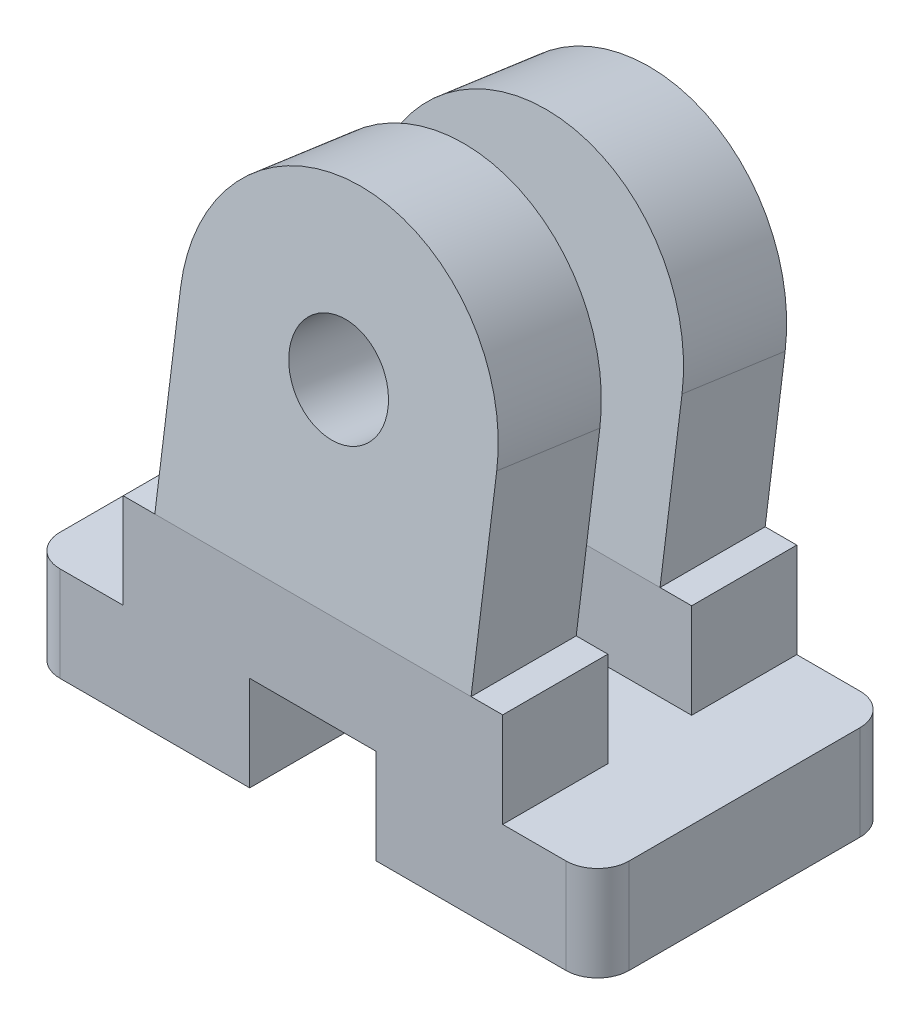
ISO-10303-21;
HEADER;
FILE_DESCRIPTION(('STEP AP214'),'2;1');
FILE_NAME('part.step','',(''),(''),'','','');
FILE_SCHEMA(('AUTOMOTIVE_DESIGN { 1 0 10303 214 1 1 1 1 }'));
ENDSEC;
DATA;
#1=APPLICATION_CONTEXT('core data for automotive mechanical design processes');
#2=APPLICATION_PROTOCOL_DEFINITION('international standard','automotive_design',2000,#1);
#3=PRODUCT_CONTEXT('',#1,'mechanical');
#4=PRODUCT('Part','Part','',(#3));
#5=PRODUCT_RELATED_PRODUCT_CATEGORY('part','',(#4));
#6=PRODUCT_DEFINITION_FORMATION('','',#4);
#7=PRODUCT_DEFINITION_CONTEXT('part definition',#1,'design');
#8=PRODUCT_DEFINITION('design','',#6,#7);
#9=PRODUCT_DEFINITION_SHAPE('','',#8);
#10=(LENGTH_UNIT() NAMED_UNIT(*) SI_UNIT(.MILLI.,.METRE.));
#11=(NAMED_UNIT(*) PLANE_ANGLE_UNIT() SI_UNIT($,.RADIAN.));
#12=(NAMED_UNIT(*) SI_UNIT($,.STERADIAN.) SOLID_ANGLE_UNIT());
#13=UNCERTAINTY_MEASURE_WITH_UNIT(LENGTH_MEASURE(1.E-05),#10,'distance_accuracy_value','');
#14=(GEOMETRIC_REPRESENTATION_CONTEXT(3) GLOBAL_UNCERTAINTY_ASSIGNED_CONTEXT((#13)) GLOBAL_UNIT_ASSIGNED_CONTEXT((#10,
#11,#12)) REPRESENTATION_CONTEXT('',''));
#15=CARTESIAN_POINT('',(0.,0.,0.));
#16=DIRECTION('',(0.,0.,1.));
#17=DIRECTION('',(1.,0.,0.));
#18=AXIS2_PLACEMENT_3D('',#15,#16,#17);
#19=CARTESIAN_POINT('',(0.,3.,0.));
#20=DIRECTION('',(0.,1.,0.));
#21=DIRECTION('',(0.,0.,1.));
#22=AXIS2_PLACEMENT_3D('',#19,#20,#21);
#23=PLANE('',#22);
#24=DIRECTION('',(0.,0.,-1.));
#25=VECTOR('',#24,1.);
#26=CARTESIAN_POINT('',(9.,3.,-4.65));
#27=LINE('',#26,#25);
#28=CARTESIAN_POINT('',(9.,3.,3.65));
#29=VERTEX_POINT('',#28);
#30=CARTESIAN_POINT('',(9.,3.,-3.65));
#31=VERTEX_POINT('',#30);
#32=EDGE_CURVE('E462',#29,#31,#27,.T.);
#33=ORIENTED_EDGE('',*,*,#32,.T.);
#34=CARTESIAN_POINT('',(8.,3.,-3.65));
#35=DIRECTION('',(0.,1.,0.));
#36=DIRECTION('',(0.,0.,1.));
#37=AXIS2_PLACEMENT_3D('',#34,#35,#36);
#38=CIRCLE('',#37,1.);
#39=CARTESIAN_POINT('',(8.,3.,-4.65));
#40=VERTEX_POINT('',#39);
#41=EDGE_CURVE('E12',#31,#40,#38,.T.);
#42=ORIENTED_EDGE('',*,*,#41,.T.);
#43=DIRECTION('',(-1.,0.,0.));
#44=VECTOR('',#43,1.);
#45=CARTESIAN_POINT('',(-9.,3.,-4.65));
#46=LINE('',#45,#44);
#47=CARTESIAN_POINT('',(6.,3.,-4.65));
#48=VERTEX_POINT('',#47);
#49=EDGE_CURVE('E472',#40,#48,#46,.T.);
#50=ORIENTED_EDGE('',*,*,#49,.T.);
#51=DIRECTION('',(0.,0.,-1.));
#52=VECTOR('',#51,1.);
#53=CARTESIAN_POINT('',(6.,3.,-4.65));
#54=LINE('',#53,#52);
#55=CARTESIAN_POINT('',(6.,3.,-1.325));
#56=VERTEX_POINT('',#55);
#57=EDGE_CURVE('E436',#56,#48,#54,.T.);
#58=ORIENTED_EDGE('',*,*,#57,.F.);
#59=DIRECTION('',(1.,0.,0.));
#60=VECTOR('',#59,1.);
#61=CARTESIAN_POINT('',(-6.,3.,-1.325));
#62=LINE('',#61,#60);
#63=CARTESIAN_POINT('',(2.,3.,-1.325));
#64=VERTEX_POINT('',#63);
#65=EDGE_CURVE('E445',#64,#56,#62,.T.);
#66=ORIENTED_EDGE('',*,*,#65,.F.);
#67=DIRECTION('',(0.,0.,1.));
#68=VECTOR('',#67,1.);
#69=CARTESIAN_POINT('',(2.,3.,4.65));
#70=LINE('',#69,#68);
#71=CARTESIAN_POINT('',(2.,3.,1.325));
#72=VERTEX_POINT('',#71);
#73=EDGE_CURVE('E284',#64,#72,#70,.T.);
#74=ORIENTED_EDGE('',*,*,#73,.T.);
#75=DIRECTION('',(-1.,0.,0.));
#76=VECTOR('',#75,1.);
#77=CARTESIAN_POINT('',(-6.,3.,1.325));
#78=LINE('',#77,#76);
#79=CARTESIAN_POINT('',(6.,3.,1.325));
#80=VERTEX_POINT('',#79);
#81=EDGE_CURVE('E564',#80,#72,#78,.T.);
#82=ORIENTED_EDGE('',*,*,#81,.F.);
#83=DIRECTION('',(0.,0.,-1.));
#84=VECTOR('',#83,1.);
#85=CARTESIAN_POINT('',(6.,3.,4.65));
#86=LINE('',#85,#84);
#87=CARTESIAN_POINT('',(6.,3.,4.65));
#88=VERTEX_POINT('',#87);
#89=EDGE_CURVE('E569',#88,#80,#86,.T.);
#90=ORIENTED_EDGE('',*,*,#89,.F.);
#91=DIRECTION('',(1.,0.,0.));
#92=VECTOR('',#91,1.);
#93=CARTESIAN_POINT('',(-9.,3.,4.65));
#94=LINE('',#93,#92);
#95=CARTESIAN_POINT('',(8.,3.,4.65));
#96=VERTEX_POINT('',#95);
#97=EDGE_CURVE('E459',#88,#96,#94,.T.);
#98=ORIENTED_EDGE('',*,*,#97,.T.);
#99=CARTESIAN_POINT('',(8.,3.,3.65));
#100=DIRECTION('',(0.,1.,0.));
#101=DIRECTION('',(0.,0.,1.));
#102=AXIS2_PLACEMENT_3D('',#99,#100,#101);
#103=CIRCLE('',#102,1.);
#104=EDGE_CURVE('E87',#96,#29,#103,.T.);
#105=ORIENTED_EDGE('',*,*,#104,.T.);
#106=EDGE_LOOP('',(#33,#42,#50,#58,#66,#74,#82,#90,#98,#105));
#107=FACE_BOUND('',#106,.T.);
#108=ADVANCED_FACE('F79',(#107),#23,.T.);
#109=CARTESIAN_POINT('',(0.,0.,0.));
#110=DIRECTION('',(0.,1.,0.));
#111=DIRECTION('',(0.,0.,1.));
#112=AXIS2_PLACEMENT_3D('',#109,#110,#111);
#113=PLANE('',#112);
#114=DIRECTION('',(-1.,0.,0.));
#115=VECTOR('',#114,1.);
#116=CARTESIAN_POINT('',(-9.,0.,-4.65));
#117=LINE('',#116,#115);
#118=CARTESIAN_POINT('',(8.,0.,-4.65));
#119=VERTEX_POINT('',#118);
#120=CARTESIAN_POINT('',(2.,0.,-4.65));
#121=VERTEX_POINT('',#120);
#122=EDGE_CURVE('E304',#119,#121,#117,.T.);
#123=ORIENTED_EDGE('',*,*,#122,.F.);
#124=CARTESIAN_POINT('',(8.,0.,-3.65));
#125=DIRECTION('',(0.,1.,0.));
#126=DIRECTION('',(0.,0.,1.));
#127=AXIS2_PLACEMENT_3D('',#124,#125,#126);
#128=CIRCLE('',#127,1.);
#129=CARTESIAN_POINT('',(9.,0.,-3.65));
#130=VERTEX_POINT('',#129);
#131=EDGE_CURVE('E492',#119,#130,#128,.F.);
#132=ORIENTED_EDGE('',*,*,#131,.T.);
#133=DIRECTION('',(0.,0.,-1.));
#134=VECTOR('',#133,1.);
#135=CARTESIAN_POINT('',(9.,0.,-4.65));
#136=LINE('',#135,#134);
#137=CARTESIAN_POINT('',(9.,0.,3.65));
#138=VERTEX_POINT('',#137);
#139=EDGE_CURVE('E500',#138,#130,#136,.T.);
#140=ORIENTED_EDGE('',*,*,#139,.F.);
#141=CARTESIAN_POINT('',(8.,0.,3.65));
#142=DIRECTION('',(0.,1.,0.));
#143=DIRECTION('',(0.,0.,1.));
#144=AXIS2_PLACEMENT_3D('',#141,#142,#143);
#145=CIRCLE('',#144,1.);
#146=CARTESIAN_POINT('',(8.,0.,4.65));
#147=VERTEX_POINT('',#146);
#148=EDGE_CURVE('E490',#138,#147,#145,.F.);
#149=ORIENTED_EDGE('',*,*,#148,.T.);
#150=DIRECTION('',(1.,0.,0.));
#151=VECTOR('',#150,1.);
#152=CARTESIAN_POINT('',(-9.,0.,4.65));
#153=LINE('',#152,#151);
#154=CARTESIAN_POINT('',(2.,0.,4.65));
#155=VERTEX_POINT('',#154);
#156=EDGE_CURVE('E509',#155,#147,#153,.T.);
#157=ORIENTED_EDGE('',*,*,#156,.F.);
#158=DIRECTION('',(0.,0.,1.));
#159=VECTOR('',#158,1.);
#160=CARTESIAN_POINT('',(2.,0.,4.65));
#161=LINE('',#160,#159);
#162=EDGE_CURVE('E298',#121,#155,#161,.T.);
#163=ORIENTED_EDGE('',*,*,#162,.F.);
#164=EDGE_LOOP('',(#123,#132,#140,#149,#157,#163));
#165=FACE_BOUND('',#164,.T.);
#166=ADVANCED_FACE('F503',(#165),#113,.F.);
#167=CARTESIAN_POINT('',(-5.,0.757071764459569,5.38684551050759));
#168=DIRECTION('',(0.,-0.139173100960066,-0.99026806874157));
#169=DIRECTION('',(0.,0.99026806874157,-0.139173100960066));
#170=AXIS2_PLACEMENT_3D('',#167,#168,#169);
#171=PLANE('',#170);
#172=CARTESIAN_POINT('',(0.,11.7748069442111,3.8384038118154));
#173=DIRECTION('',(0.,0.139173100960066,0.99026806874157));
#174=DIRECTION('',(0.,-0.99026806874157,0.139173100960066));
#175=AXIS2_PLACEMENT_3D('',#172,#173,#174);
#176=CIRCLE('',#175,1.5625);
#177=CARTESIAN_POINT('',(0.,10.2275130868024,4.0558617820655));
#178=VERTEX_POINT('',#177);
#179=EDGE_CURVE('E329',#178,#178,#176,.T.);
#180=ORIENTED_EDGE('',*,*,#179,.F.);
#181=EDGE_LOOP('',(#180));
#182=FACE_BOUND('',#181,.T.);
#183=DIRECTION('',(0.,0.99026806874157,-0.139173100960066));
#184=VECTOR('',#183,1.);
#185=CARTESIAN_POINT('',(5.,0.757071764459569,5.38684551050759));
#186=LINE('',#185,#184);
#187=CARTESIAN_POINT('',(5.,6.,4.65));
#188=VERTEX_POINT('',#187);
#189=CARTESIAN_POINT('',(5.,11.7748069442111,3.8384038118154));
#190=VERTEX_POINT('',#189);
#191=EDGE_CURVE('E374',#188,#190,#186,.T.);
#192=ORIENTED_EDGE('',*,*,#191,.T.);
#193=CARTESIAN_POINT('',(0.,11.7748069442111,3.8384038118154));
#194=DIRECTION('',(0.,0.139173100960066,0.99026806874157));
#195=DIRECTION('',(0.,-0.99026806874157,0.139173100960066));
#196=AXIS2_PLACEMENT_3D('',#193,#194,#195);
#197=CIRCLE('',#196,5.);
#198=CARTESIAN_POINT('',(-5.,11.7748069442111,3.8384038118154));
#199=VERTEX_POINT('',#198);
#200=EDGE_CURVE('E318',#190,#199,#197,.T.);
#201=ORIENTED_EDGE('',*,*,#200,.T.);
#202=DIRECTION('',(0.,0.99026806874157,-0.139173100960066));
#203=VECTOR('',#202,1.);
#204=CARTESIAN_POINT('',(-5.,0.757071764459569,5.38684551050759));
#205=LINE('',#204,#203);
#206=CARTESIAN_POINT('',(-5.,6.,4.65));
#207=VERTEX_POINT('',#206);
#208=EDGE_CURVE('E604',#207,#199,#205,.T.);
#209=ORIENTED_EDGE('',*,*,#208,.F.);
#210=DIRECTION('',(1.,0.,0.));
#211=VECTOR('',#210,1.);
#212=CARTESIAN_POINT('',(-5.,6.,4.65));
#213=LINE('',#212,#211);
#214=EDGE_CURVE('E571',#207,#188,#213,.T.);
#215=ORIENTED_EDGE('',*,*,#214,.T.);
#216=EDGE_LOOP('',(#192,#201,#209,#215));
#217=FACE_BOUND('',#216,.T.);
#218=ADVANCED_FACE('F679',(#182,#217),#171,.F.);
#219=CARTESIAN_POINT('',(-5.,0.298824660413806,2.12624794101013));
#220=DIRECTION('',(0.,0.139173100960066,0.99026806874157));
#221=DIRECTION('',(0.,-0.99026806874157,0.139173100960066));
#222=AXIS2_PLACEMENT_3D('',#219,#220,#221);
#223=PLANE('',#222);
#224=CARTESIAN_POINT('',(0.,11.3165598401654,0.577806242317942));
#225=DIRECTION('',(0.,0.139173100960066,0.99026806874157));
#226=DIRECTION('',(0.,-0.99026806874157,0.139173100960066));
#227=AXIS2_PLACEMENT_3D('',#224,#225,#226);
#228=CIRCLE('',#227,1.5625);
#229=CARTESIAN_POINT('',(0.,9.76926598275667,0.795264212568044));
#230=VERTEX_POINT('',#229);
#231=EDGE_CURVE('E336',#230,#230,#228,.T.);
#232=ORIENTED_EDGE('',*,*,#231,.T.);
#233=EDGE_LOOP('',(#232));
#234=FACE_BOUND('',#233,.T.);
#235=CARTESIAN_POINT('',(0.,11.3165598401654,0.577806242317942));
#236=DIRECTION('',(0.,0.139173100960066,0.99026806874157));
#237=DIRECTION('',(0.,-0.99026806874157,0.139173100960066));
#238=AXIS2_PLACEMENT_3D('',#235,#236,#237);
#239=CIRCLE('',#238,5.);
#240=CARTESIAN_POINT('',(5.,11.3165598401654,0.577806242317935));
#241=VERTEX_POINT('',#240);
#242=CARTESIAN_POINT('',(-5.,11.3165598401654,0.57780624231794));
#243=VERTEX_POINT('',#242);
#244=EDGE_CURVE('E327',#241,#243,#239,.T.);
#245=ORIENTED_EDGE('',*,*,#244,.F.);
#246=DIRECTION('',(0.,-0.99026806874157,0.139173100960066));
#247=VECTOR('',#246,1.);
#248=CARTESIAN_POINT('',(5.,0.298824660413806,2.12624794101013));
#249=LINE('',#248,#247);
#250=CARTESIAN_POINT('',(5.,6.,1.325));
#251=VERTEX_POINT('',#250);
#252=EDGE_CURVE('E371',#241,#251,#249,.T.);
#253=ORIENTED_EDGE('',*,*,#252,.T.);
#254=DIRECTION('',(1.,0.,0.));
#255=VECTOR('',#254,1.);
#256=CARTESIAN_POINT('',(-5.,6.,1.325));
#257=LINE('',#256,#255);
#258=CARTESIAN_POINT('',(-5.,6.,1.325));
#259=VERTEX_POINT('',#258);
#260=EDGE_CURVE('E599',#259,#251,#257,.T.);
#261=ORIENTED_EDGE('',*,*,#260,.F.);
#262=DIRECTION('',(0.,-0.99026806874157,0.139173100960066));
#263=VECTOR('',#262,1.);
#264=CARTESIAN_POINT('',(-5.,0.298824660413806,2.12624794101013));
#265=LINE('',#264,#263);
#266=EDGE_CURVE('E363',#243,#259,#265,.T.);
#267=ORIENTED_EDGE('',*,*,#266,.F.);
#268=EDGE_LOOP('',(#245,#253,#261,#267));
#269=FACE_BOUND('',#268,.T.);
#270=ADVANCED_FACE('F625',(#234,#269),#223,.F.);
#271=CARTESIAN_POINT('',(-5.,-0.0663948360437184,-0.472423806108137));
#272=DIRECTION('',(0.,-0.139173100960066,-0.99026806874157));
#273=DIRECTION('',(0.,0.99026806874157,-0.139173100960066));
#274=AXIS2_PLACEMENT_3D('',#271,#272,#273);
#275=PLANE('',#274);
#276=CARTESIAN_POINT('',(0.,10.9513403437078,-2.02086550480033));
#277=DIRECTION('',(0.,-0.139173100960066,-0.99026806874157));
#278=DIRECTION('',(0.,0.99026806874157,-0.139173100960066));
#279=AXIS2_PLACEMENT_3D('',#276,#277,#278);
#280=CIRCLE('',#279,1.5625);
#281=CARTESIAN_POINT('',(0.,9.40404648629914,-1.80340753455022));
#282=VERTEX_POINT('',#281);
#283=EDGE_CURVE('E333',#282,#282,#280,.T.);
#284=ORIENTED_EDGE('',*,*,#283,.T.);
#285=EDGE_LOOP('',(#284));
#286=FACE_BOUND('',#285,.T.);
#287=DIRECTION('',(0.,0.99026806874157,-0.139173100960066));
#288=VECTOR('',#287,1.);
#289=CARTESIAN_POINT('',(5.,-0.0663948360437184,-0.472423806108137));
#290=LINE('',#289,#288);
#291=CARTESIAN_POINT('',(5.,6.,-1.325));
#292=VERTEX_POINT('',#291);
#293=CARTESIAN_POINT('',(5.,10.9513403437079,-2.02086550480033));
#294=VERTEX_POINT('',#293);
#295=EDGE_CURVE('E339',#292,#294,#290,.T.);
#296=ORIENTED_EDGE('',*,*,#295,.T.);
#297=CARTESIAN_POINT('',(0.,10.9513403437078,-2.02086550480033));
#298=DIRECTION('',(0.,-0.139173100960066,-0.99026806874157));
#299=DIRECTION('',(0.,0.99026806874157,-0.139173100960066));
#300=AXIS2_PLACEMENT_3D('',#297,#298,#299);
#301=CIRCLE('',#300,5.);
#302=CARTESIAN_POINT('',(-5.,10.9513403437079,-2.02086550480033));
#303=VERTEX_POINT('',#302);
#304=EDGE_CURVE('E325',#303,#294,#301,.T.);
#305=ORIENTED_EDGE('',*,*,#304,.F.);
#306=DIRECTION('',(0.,0.99026806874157,-0.139173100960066));
#307=VECTOR('',#306,1.);
#308=CARTESIAN_POINT('',(-5.,-0.0663948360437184,-0.472423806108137));
#309=LINE('',#308,#307);
#310=CARTESIAN_POINT('',(-5.,6.,-1.325));
#311=VERTEX_POINT('',#310);
#312=EDGE_CURVE('E362',#311,#303,#309,.T.);
#313=ORIENTED_EDGE('',*,*,#312,.F.);
#314=DIRECTION('',(1.,0.,0.));
#315=VECTOR('',#314,1.);
#316=CARTESIAN_POINT('',(-5.,6.,-1.325));
#317=LINE('',#316,#315);
#318=EDGE_CURVE('E635',#311,#292,#317,.T.);
#319=ORIENTED_EDGE('',*,*,#318,.T.);
#320=EDGE_LOOP('',(#296,#305,#313,#319));
#321=FACE_BOUND('',#320,.T.);
#322=ADVANCED_FACE('F654',(#286,#321),#275,.F.);
#323=CARTESIAN_POINT('',(-5.,-0.52464194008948,-3.73302137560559));
#324=DIRECTION('',(0.,0.139173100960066,0.99026806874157));
#325=DIRECTION('',(0.,-0.99026806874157,0.139173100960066));
#326=AXIS2_PLACEMENT_3D('',#323,#324,#325);
#327=PLANE('',#326);
#328=CARTESIAN_POINT('',(0.,10.4930932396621,-5.28146307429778));
#329=DIRECTION('',(0.,0.139173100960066,0.99026806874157));
#330=DIRECTION('',(0.,-0.99026806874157,0.139173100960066));
#331=AXIS2_PLACEMENT_3D('',#328,#329,#330);
#332=CIRCLE('',#331,1.5625);
#333=CARTESIAN_POINT('',(0.,8.94579938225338,-5.06400510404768));
#334=VERTEX_POINT('',#333);
#335=EDGE_CURVE('E332',#334,#334,#332,.T.);
#336=ORIENTED_EDGE('',*,*,#335,.T.);
#337=EDGE_LOOP('',(#336));
#338=FACE_BOUND('',#337,.T.);
#339=CARTESIAN_POINT('',(0.,10.4930932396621,-5.28146307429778));
#340=DIRECTION('',(0.,0.139173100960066,0.99026806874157));
#341=DIRECTION('',(0.,-0.99026806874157,0.139173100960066));
#342=AXIS2_PLACEMENT_3D('',#339,#340,#341);
#343=CIRCLE('',#342,5.);
#344=CARTESIAN_POINT('',(5.,10.4930932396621,-5.28146307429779));
#345=VERTEX_POINT('',#344);
#346=CARTESIAN_POINT('',(-5.,10.4930932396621,-5.28146307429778));
#347=VERTEX_POINT('',#346);
#348=EDGE_CURVE('E323',#345,#347,#343,.T.);
#349=ORIENTED_EDGE('',*,*,#348,.F.);
#350=DIRECTION('',(0.,-0.99026806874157,0.139173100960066));
#351=VECTOR('',#350,1.);
#352=CARTESIAN_POINT('',(5.,-0.52464194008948,-3.73302137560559));
#353=LINE('',#352,#351);
#354=CARTESIAN_POINT('',(5.,6.,-4.65));
#355=VERTEX_POINT('',#354);
#356=EDGE_CURVE('E349',#345,#355,#353,.T.);
#357=ORIENTED_EDGE('',*,*,#356,.T.);
#358=DIRECTION('',(1.,0.,0.));
#359=VECTOR('',#358,1.);
#360=CARTESIAN_POINT('',(-5.,6.,-4.65));
#361=LINE('',#360,#359);
#362=CARTESIAN_POINT('',(-5.,6.,-4.65));
#363=VERTEX_POINT('',#362);
#364=EDGE_CURVE('E634',#363,#355,#361,.T.);
#365=ORIENTED_EDGE('',*,*,#364,.F.);
#366=DIRECTION('',(0.,-0.99026806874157,0.139173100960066));
#367=VECTOR('',#366,1.);
#368=CARTESIAN_POINT('',(-5.,-0.52464194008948,-3.73302137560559));
#369=LINE('',#368,#367);
#370=EDGE_CURVE('E638',#347,#363,#369,.T.);
#371=ORIENTED_EDGE('',*,*,#370,.F.);
#372=EDGE_LOOP('',(#349,#357,#365,#371));
#373=FACE_BOUND('',#372,.T.);
#374=ADVANCED_FACE('F767',(#338,#373),#327,.F.);
#375=CARTESIAN_POINT('',(5.,0.,0.));
#376=DIRECTION('',(1.,0.,0.));
#377=DIRECTION('',(0.,0.,-1.));
#378=AXIS2_PLACEMENT_3D('',#375,#376,#377);
#379=PLANE('',#378);
#380=ORIENTED_EDGE('',*,*,#252,.F.);
#381=DIRECTION('',(0.,0.139173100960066,0.99026806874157));
#382=VECTOR('',#381,1.);
#383=CARTESIAN_POINT('',(5.,10.1939442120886,-7.41001900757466));
#384=LINE('',#383,#382);
#385=EDGE_CURVE('E315',#241,#190,#384,.T.);
#386=ORIENTED_EDGE('',*,*,#385,.T.);
#387=ORIENTED_EDGE('',*,*,#191,.F.);
#388=DIRECTION('',(0.,0.,1.));
#389=VECTOR('',#388,1.);
#390=CARTESIAN_POINT('',(5.,6.,0.));
#391=LINE('',#390,#389);
#392=EDGE_CURVE('E375',#251,#188,#391,.T.);
#393=ORIENTED_EDGE('',*,*,#392,.F.);
#394=EDGE_LOOP('',(#380,#386,#387,#393));
#395=FACE_BOUND('',#394,.T.);
#396=ADVANCED_FACE('F630',(#395),#379,.T.);
#397=CARTESIAN_POINT('',(5.,0.,0.));
#398=DIRECTION('',(1.,0.,0.));
#399=DIRECTION('',(0.,0.,-1.));
#400=AXIS2_PLACEMENT_3D('',#397,#398,#399);
#401=PLANE('',#400);
#402=ORIENTED_EDGE('',*,*,#356,.F.);
#403=DIRECTION('',(0.,0.139173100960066,0.99026806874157));
#404=VECTOR('',#403,1.);
#405=CARTESIAN_POINT('',(5.,10.1939442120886,-7.41001900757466));
#406=LINE('',#405,#404);
#407=EDGE_CURVE('E366',#345,#294,#406,.T.);
#408=ORIENTED_EDGE('',*,*,#407,.T.);
#409=ORIENTED_EDGE('',*,*,#295,.F.);
#410=DIRECTION('',(0.,0.,-1.));
#411=VECTOR('',#410,1.);
#412=CARTESIAN_POINT('',(5.,6.,0.));
#413=LINE('',#412,#411);
#414=EDGE_CURVE('E345',#292,#355,#413,.T.);
#415=ORIENTED_EDGE('',*,*,#414,.T.);
#416=EDGE_LOOP('',(#402,#408,#409,#415));
#417=FACE_BOUND('',#416,.T.);
#418=ADVANCED_FACE('F665',(#417),#401,.T.);
#419=CARTESIAN_POINT('',(-5.,0.,0.));
#420=DIRECTION('',(1.,0.,0.));
#421=DIRECTION('',(0.,0.,-1.));
#422=AXIS2_PLACEMENT_3D('',#419,#420,#421);
#423=PLANE('',#422);
#424=DIRECTION('',(0.,0.139173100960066,0.99026806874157));
#425=VECTOR('',#424,1.);
#426=CARTESIAN_POINT('',(-5.,10.1939442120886,-7.41001900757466));
#427=LINE('',#426,#425);
#428=EDGE_CURVE('E321',#243,#199,#427,.T.);
#429=ORIENTED_EDGE('',*,*,#428,.F.);
#430=ORIENTED_EDGE('',*,*,#266,.T.);
#431=DIRECTION('',(0.,0.,1.));
#432=VECTOR('',#431,1.);
#433=CARTESIAN_POINT('',(-5.,6.,0.));
#434=LINE('',#433,#432);
#435=EDGE_CURVE('E383',#259,#207,#434,.T.);
#436=ORIENTED_EDGE('',*,*,#435,.T.);
#437=ORIENTED_EDGE('',*,*,#208,.T.);
#438=EDGE_LOOP('',(#429,#430,#436,#437));
#439=FACE_BOUND('',#438,.T.);
#440=ADVANCED_FACE('F616',(#439),#423,.F.);
#441=CARTESIAN_POINT('',(-5.,0.,0.));
#442=DIRECTION('',(1.,0.,0.));
#443=DIRECTION('',(0.,0.,-1.));
#444=AXIS2_PLACEMENT_3D('',#441,#442,#443);
#445=PLANE('',#444);
#446=DIRECTION('',(0.,0.139173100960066,0.99026806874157));
#447=VECTOR('',#446,1.);
#448=CARTESIAN_POINT('',(-5.,10.1939442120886,-7.41001900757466));
#449=LINE('',#448,#447);
#450=EDGE_CURVE('E370',#347,#303,#449,.T.);
#451=ORIENTED_EDGE('',*,*,#450,.F.);
#452=ORIENTED_EDGE('',*,*,#370,.T.);
#453=DIRECTION('',(0.,0.,-1.));
#454=VECTOR('',#453,1.);
#455=CARTESIAN_POINT('',(-5.,6.,0.));
#456=LINE('',#455,#454);
#457=EDGE_CURVE('E426',#311,#363,#456,.T.);
#458=ORIENTED_EDGE('',*,*,#457,.F.);
#459=ORIENTED_EDGE('',*,*,#312,.T.);
#460=EDGE_LOOP('',(#451,#452,#458,#459));
#461=FACE_BOUND('',#460,.T.);
#462=ADVANCED_FACE('F656',(#461),#445,.F.);
#463=CARTESIAN_POINT('',(0.,6.,0.));
#464=DIRECTION('',(0.,1.,0.));
#465=DIRECTION('',(0.,0.,1.));
#466=AXIS2_PLACEMENT_3D('',#463,#464,#465);
#467=PLANE('',#466);
#468=DIRECTION('',(1.,0.,0.));
#469=VECTOR('',#468,1.);
#470=CARTESIAN_POINT('',(-6.,6.,-1.325));
#471=LINE('',#470,#469);
#472=CARTESIAN_POINT('',(-6.,6.,-1.325));
#473=VERTEX_POINT('',#472);
#474=EDGE_CURVE('E386',#473,#311,#471,.T.);
#475=ORIENTED_EDGE('',*,*,#474,.T.);
#476=ORIENTED_EDGE('',*,*,#457,.T.);
#477=DIRECTION('',(-1.,0.,0.));
#478=VECTOR('',#477,1.);
#479=CARTESIAN_POINT('',(-6.,6.,-4.65));
#480=LINE('',#479,#478);
#481=CARTESIAN_POINT('',(-6.,6.,-4.65));
#482=VERTEX_POINT('',#481);
#483=EDGE_CURVE('E400',#363,#482,#480,.T.);
#484=ORIENTED_EDGE('',*,*,#483,.T.);
#485=DIRECTION('',(0.,0.,1.));
#486=VECTOR('',#485,1.);
#487=CARTESIAN_POINT('',(-6.,6.,-4.65));
#488=LINE('',#487,#486);
#489=EDGE_CURVE('E396',#482,#473,#488,.T.);
#490=ORIENTED_EDGE('',*,*,#489,.T.);
#491=EDGE_LOOP('',(#475,#476,#484,#490));
#492=FACE_BOUND('',#491,.T.);
#493=ADVANCED_FACE('F422',(#492),#467,.T.);
#494=CARTESIAN_POINT('',(0.,6.,0.));
#495=DIRECTION('',(0.,1.,0.));
#496=DIRECTION('',(0.,0.,1.));
#497=AXIS2_PLACEMENT_3D('',#494,#495,#496);
#498=PLANE('',#497);
#499=DIRECTION('',(-1.,0.,0.));
#500=VECTOR('',#499,1.);
#501=CARTESIAN_POINT('',(-6.,6.,1.325));
#502=LINE('',#501,#500);
#503=CARTESIAN_POINT('',(6.,6.,1.325));
#504=VERTEX_POINT('',#503);
#505=EDGE_CURVE('E573',#504,#251,#502,.T.);
#506=ORIENTED_EDGE('',*,*,#505,.T.);
#507=ORIENTED_EDGE('',*,*,#392,.T.);
#508=DIRECTION('',(1.,0.,0.));
#509=VECTOR('',#508,1.);
#510=CARTESIAN_POINT('',(-6.,6.,4.65));
#511=LINE('',#510,#509);
#512=CARTESIAN_POINT('',(6.,6.,4.65));
#513=VERTEX_POINT('',#512);
#514=EDGE_CURVE('E563',#188,#513,#511,.T.);
#515=ORIENTED_EDGE('',*,*,#514,.T.);
#516=DIRECTION('',(0.,0.,-1.));
#517=VECTOR('',#516,1.);
#518=CARTESIAN_POINT('',(6.,6.,4.65));
#519=LINE('',#518,#517);
#520=EDGE_CURVE('E576',#513,#504,#519,.T.);
#521=ORIENTED_EDGE('',*,*,#520,.T.);
#522=EDGE_LOOP('',(#506,#507,#515,#521));
#523=FACE_BOUND('',#522,.T.);
#524=ADVANCED_FACE('F683',(#523),#498,.T.);
#525=CARTESIAN_POINT('',(-6.,3.,-4.65));
#526=VERTEX_POINT('',#525);
#527=CARTESIAN_POINT('',(-8.,3.,-4.65));
#528=VERTEX_POINT('',#527);
#529=EDGE_CURVE('E430',#526,#528,#46,.T.);
#530=ORIENTED_EDGE('',*,*,#529,.T.);
#531=CARTESIAN_POINT('',(-8.,3.,-3.65));
#532=DIRECTION('',(0.,1.,0.));
#533=DIRECTION('',(0.,0.,1.));
#534=AXIS2_PLACEMENT_3D('',#531,#532,#533);
#535=CIRCLE('',#534,1.);
#536=CARTESIAN_POINT('',(-9.,3.,-3.65));
#537=VERTEX_POINT('',#536);
#538=EDGE_CURVE('E483',#528,#537,#535,.T.);
#539=ORIENTED_EDGE('',*,*,#538,.T.);
#540=DIRECTION('',(0.,0.,1.));
#541=VECTOR('',#540,1.);
#542=CARTESIAN_POINT('',(-9.,3.,-4.65));
#543=LINE('',#542,#541);
#544=CARTESIAN_POINT('',(-9.,3.,3.65));
#545=VERTEX_POINT('',#544);
#546=EDGE_CURVE('E456',#537,#545,#543,.T.);
#547=ORIENTED_EDGE('',*,*,#546,.T.);
#548=CARTESIAN_POINT('',(-8.,3.,3.65));
#549=DIRECTION('',(0.,1.,0.));
#550=DIRECTION('',(0.,0.,1.));
#551=AXIS2_PLACEMENT_3D('',#548,#549,#550);
#552=CIRCLE('',#551,1.);
#553=CARTESIAN_POINT('',(-8.,3.,4.65));
#554=VERTEX_POINT('',#553);
#555=EDGE_CURVE('E481',#545,#554,#552,.T.);
#556=ORIENTED_EDGE('',*,*,#555,.T.);
#557=CARTESIAN_POINT('',(-6.,3.,4.65));
#558=VERTEX_POINT('',#557);
#559=EDGE_CURVE('E460',#554,#558,#94,.T.);
#560=ORIENTED_EDGE('',*,*,#559,.T.);
#561=DIRECTION('',(0.,0.,1.));
#562=VECTOR('',#561,1.);
#563=CARTESIAN_POINT('',(-6.,3.,4.65));
#564=LINE('',#563,#562);
#565=CARTESIAN_POINT('',(-6.,3.,1.325));
#566=VERTEX_POINT('',#565);
#567=EDGE_CURVE('E560',#566,#558,#564,.T.);
#568=ORIENTED_EDGE('',*,*,#567,.F.);
#569=CARTESIAN_POINT('',(-2.,3.,1.325));
#570=VERTEX_POINT('',#569);
#571=EDGE_CURVE('E568',#570,#566,#78,.T.);
#572=ORIENTED_EDGE('',*,*,#571,.F.);
#573=DIRECTION('',(0.,0.,-1.));
#574=VECTOR('',#573,1.);
#575=CARTESIAN_POINT('',(-2.,3.,4.65));
#576=LINE('',#575,#574);
#577=CARTESIAN_POINT('',(-2.,3.,-1.325));
#578=VERTEX_POINT('',#577);
#579=EDGE_CURVE('E1004',#570,#578,#576,.T.);
#580=ORIENTED_EDGE('',*,*,#579,.T.);
#581=CARTESIAN_POINT('',(-6.,3.,-1.325));
#582=VERTEX_POINT('',#581);
#583=EDGE_CURVE('E403',#582,#578,#62,.T.);
#584=ORIENTED_EDGE('',*,*,#583,.F.);
#585=DIRECTION('',(0.,0.,1.));
#586=VECTOR('',#585,1.);
#587=CARTESIAN_POINT('',(-6.,3.,-4.65));
#588=LINE('',#587,#586);
#589=EDGE_CURVE('E540',#526,#582,#588,.T.);
#590=ORIENTED_EDGE('',*,*,#589,.F.);
#591=EDGE_LOOP('',(#530,#539,#547,#556,#560,#568,#572,#580,#584,#590));
#592=FACE_BOUND('',#591,.T.);
#593=ADVANCED_FACE('F539',(#592),#23,.T.);
#594=CARTESIAN_POINT('',(-9.,3.,-4.65));
#595=DIRECTION('',(1.,0.,0.));
#596=DIRECTION('',(0.,0.,-1.));
#597=AXIS2_PLACEMENT_3D('',#594,#595,#596);
#598=PLANE('',#597);
#599=ORIENTED_EDGE('',*,*,#546,.F.);
#600=DIRECTION('',(0.,-1.,0.));
#601=VECTOR('',#600,1.);
#602=CARTESIAN_POINT('',(-9.,3.,-3.65));
#603=LINE('',#602,#601);
#604=CARTESIAN_POINT('',(-9.,0.,-3.65));
#605=VERTEX_POINT('',#604);
#606=EDGE_CURVE('E524',#537,#605,#603,.T.);
#607=ORIENTED_EDGE('',*,*,#606,.T.);
#608=DIRECTION('',(0.,0.,1.));
#609=VECTOR('',#608,1.);
#610=CARTESIAN_POINT('',(-9.,0.,-4.65));
#611=LINE('',#610,#609);
#612=CARTESIAN_POINT('',(-9.,0.,3.65));
#613=VERTEX_POINT('',#612);
#614=EDGE_CURVE('E455',#605,#613,#611,.T.);
#615=ORIENTED_EDGE('',*,*,#614,.T.);
#616=DIRECTION('',(0.,-1.,0.));
#617=VECTOR('',#616,1.);
#618=CARTESIAN_POINT('',(-9.,3.,3.65));
#619=LINE('',#618,#617);
#620=EDGE_CURVE('E369',#613,#545,#619,.F.);
#621=ORIENTED_EDGE('',*,*,#620,.T.);
#622=EDGE_LOOP('',(#599,#607,#615,#621));
#623=FACE_BOUND('',#622,.T.);
#624=ADVANCED_FACE('F522',(#623),#598,.F.);
#625=CARTESIAN_POINT('',(-9.,3.,4.65));
#626=DIRECTION('',(0.,0.,-1.));
#627=DIRECTION('',(-1.,0.,0.));
#628=AXIS2_PLACEMENT_3D('',#625,#626,#627);
#629=PLANE('',#628);
#630=ORIENTED_EDGE('',*,*,#559,.F.);
#631=DIRECTION('',(0.,-1.,0.));
#632=VECTOR('',#631,1.);
#633=CARTESIAN_POINT('',(-8.,3.,4.65));
#634=LINE('',#633,#632);
#635=CARTESIAN_POINT('',(-8.,0.,4.65));
#636=VERTEX_POINT('',#635);
#637=EDGE_CURVE('E487',#554,#636,#634,.T.);
#638=ORIENTED_EDGE('',*,*,#637,.T.);
#639=CARTESIAN_POINT('',(-2.,0.,4.65));
#640=VERTEX_POINT('',#639);
#641=EDGE_CURVE('E507',#636,#640,#153,.T.);
#642=ORIENTED_EDGE('',*,*,#641,.T.);
#643=DIRECTION('',(0.,-1.,0.));
#644=VECTOR('',#643,1.);
#645=CARTESIAN_POINT('',(-2.,13.1237344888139,4.65));
#646=LINE('',#645,#644);
#647=CARTESIAN_POINT('',(-2.,3.,4.65));
#648=VERTEX_POINT('',#647);
#649=EDGE_CURVE('E994',#648,#640,#646,.T.);
#650=ORIENTED_EDGE('',*,*,#649,.F.);
#651=DIRECTION('',(-1.,0.,0.));
#652=VECTOR('',#651,1.);
#653=CARTESIAN_POINT('',(-2.,3.,4.65));
#654=LINE('',#653,#652);
#655=CARTESIAN_POINT('',(2.,3.,4.65));
#656=VERTEX_POINT('',#655);
#657=EDGE_CURVE('E999',#656,#648,#654,.T.);
#658=ORIENTED_EDGE('',*,*,#657,.F.);
#659=DIRECTION('',(0.,-1.,0.));
#660=VECTOR('',#659,1.);
#661=CARTESIAN_POINT('',(2.,13.1237344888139,4.65));
#662=LINE('',#661,#660);
#663=EDGE_CURVE('E287',#656,#155,#662,.T.);
#664=ORIENTED_EDGE('',*,*,#663,.T.);
#665=ORIENTED_EDGE('',*,*,#156,.T.);
#666=DIRECTION('',(0.,-1.,0.));
#667=VECTOR('',#666,1.);
#668=CARTESIAN_POINT('',(8.,3.,4.65));
#669=LINE('',#668,#667);
#670=EDGE_CURVE('E485',#147,#96,#669,.F.);
#671=ORIENTED_EDGE('',*,*,#670,.T.);
#672=ORIENTED_EDGE('',*,*,#97,.F.);
#673=DIRECTION('',(0.,-1.,0.));
#674=VECTOR('',#673,1.);
#675=CARTESIAN_POINT('',(6.,6.,4.65));
#676=LINE('',#675,#674);
#677=EDGE_CURVE('E542',#513,#88,#676,.T.);
#678=ORIENTED_EDGE('',*,*,#677,.F.);
#679=ORIENTED_EDGE('',*,*,#514,.F.);
#680=ORIENTED_EDGE('',*,*,#214,.F.);
#681=CARTESIAN_POINT('',(-6.,6.,4.65));
#682=VERTEX_POINT('',#681);
#683=EDGE_CURVE('E586',#682,#207,#511,.T.);
#684=ORIENTED_EDGE('',*,*,#683,.F.);
#685=DIRECTION('',(0.,-1.,0.));
#686=VECTOR('',#685,1.);
#687=CARTESIAN_POINT('',(-6.,6.,4.65));
#688=LINE('',#687,#686);
#689=EDGE_CURVE('E556',#682,#558,#688,.T.);
#690=ORIENTED_EDGE('',*,*,#689,.T.);
#691=EDGE_LOOP('',(#630,#638,#642,#650,#658,#664,#665,#671,#672,#678,#679,#680,#684,#690));
#692=FACE_BOUND('',#691,.T.);
#693=ADVANCED_FACE('F688',(#692),#629,.F.);
#694=CARTESIAN_POINT('',(9.,3.,-4.65));
#695=DIRECTION('',(-1.,0.,0.));
#696=DIRECTION('',(0.,0.,1.));
#697=AXIS2_PLACEMENT_3D('',#694,#695,#696);
#698=PLANE('',#697);
#699=ORIENTED_EDGE('',*,*,#139,.T.);
#700=DIRECTION('',(0.,-1.,0.));
#701=VECTOR('',#700,1.);
#702=CARTESIAN_POINT('',(9.,3.,-3.65));
#703=LINE('',#702,#701);
#704=EDGE_CURVE('E94',#130,#31,#703,.F.);
#705=ORIENTED_EDGE('',*,*,#704,.T.);
#706=ORIENTED_EDGE('',*,*,#32,.F.);
#707=DIRECTION('',(0.,-1.,0.));
#708=VECTOR('',#707,1.);
#709=CARTESIAN_POINT('',(9.,3.,3.65));
#710=LINE('',#709,#708);
#711=EDGE_CURVE('E494',#29,#138,#710,.T.);
#712=ORIENTED_EDGE('',*,*,#711,.T.);
#713=EDGE_LOOP('',(#699,#705,#706,#712));
#714=FACE_BOUND('',#713,.T.);
#715=ADVANCED_FACE('F499',(#714),#698,.F.);
#716=CARTESIAN_POINT('',(-9.,3.,-4.65));
#717=DIRECTION('',(0.,0.,1.));
#718=DIRECTION('',(1.,0.,0.));
#719=AXIS2_PLACEMENT_3D('',#716,#717,#718);
#720=PLANE('',#719);
#721=CARTESIAN_POINT('',(-2.,0.,-4.65));
#722=VERTEX_POINT('',#721);
#723=CARTESIAN_POINT('',(-8.,0.,-4.65));
#724=VERTEX_POINT('',#723);
#725=EDGE_CURVE('E506',#722,#724,#117,.T.);
#726=ORIENTED_EDGE('',*,*,#725,.T.);
#727=DIRECTION('',(0.,-1.,0.));
#728=VECTOR('',#727,1.);
#729=CARTESIAN_POINT('',(-8.,3.,-4.65));
#730=LINE('',#729,#728);
#731=EDGE_CURVE('E479',#724,#528,#730,.F.);
#732=ORIENTED_EDGE('',*,*,#731,.T.);
#733=ORIENTED_EDGE('',*,*,#529,.F.);
#734=DIRECTION('',(0.,-1.,0.));
#735=VECTOR('',#734,1.);
#736=CARTESIAN_POINT('',(-6.,6.,-4.65));
#737=LINE('',#736,#735);
#738=EDGE_CURVE('E410',#482,#526,#737,.T.);
#739=ORIENTED_EDGE('',*,*,#738,.F.);
#740=ORIENTED_EDGE('',*,*,#483,.F.);
#741=ORIENTED_EDGE('',*,*,#364,.T.);
#742=CARTESIAN_POINT('',(6.,6.,-4.65));
#743=VERTEX_POINT('',#742);
#744=EDGE_CURVE('E408',#743,#355,#480,.T.);
#745=ORIENTED_EDGE('',*,*,#744,.F.);
#746=DIRECTION('',(0.,-1.,0.));
#747=VECTOR('',#746,1.);
#748=CARTESIAN_POINT('',(6.,6.,-4.65));
#749=LINE('',#748,#747);
#750=EDGE_CURVE('E415',#743,#48,#749,.T.);
#751=ORIENTED_EDGE('',*,*,#750,.T.);
#752=ORIENTED_EDGE('',*,*,#49,.F.);
#753=DIRECTION('',(0.,-1.,0.));
#754=VECTOR('',#753,1.);
#755=CARTESIAN_POINT('',(8.,3.,-4.65));
#756=LINE('',#755,#754);
#757=EDGE_CURVE('E477',#40,#119,#756,.T.);
#758=ORIENTED_EDGE('',*,*,#757,.T.);
#759=ORIENTED_EDGE('',*,*,#122,.T.);
#760=DIRECTION('',(0.,-1.,0.));
#761=VECTOR('',#760,1.);
#762=CARTESIAN_POINT('',(2.,13.1237344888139,-4.65));
#763=LINE('',#762,#761);
#764=CARTESIAN_POINT('',(2.,3.,-4.65));
#765=VERTEX_POINT('',#764);
#766=EDGE_CURVE('E280',#765,#121,#763,.T.);
#767=ORIENTED_EDGE('',*,*,#766,.F.);
#768=DIRECTION('',(1.,0.,0.));
#769=VECTOR('',#768,1.);
#770=CARTESIAN_POINT('',(-2.,3.,-4.65));
#771=LINE('',#770,#769);
#772=CARTESIAN_POINT('',(-2.,3.,-4.65));
#773=VERTEX_POINT('',#772);
#774=EDGE_CURVE('E291',#773,#765,#771,.T.);
#775=ORIENTED_EDGE('',*,*,#774,.F.);
#776=DIRECTION('',(0.,-1.,0.));
#777=VECTOR('',#776,1.);
#778=CARTESIAN_POINT('',(-2.,13.1237344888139,-4.65));
#779=LINE('',#778,#777);
#780=EDGE_CURVE('E309',#773,#722,#779,.T.);
#781=ORIENTED_EDGE('',*,*,#780,.T.);
#782=EDGE_LOOP('',(#726,#732,#733,#739,#740,#741,#745,#751,#752,#758,#759,#767,#775,#781));
#783=FACE_BOUND('',#782,.T.);
#784=ADVANCED_FACE('F301',(#783),#720,.F.);
#785=ORIENTED_EDGE('',*,*,#614,.F.);
#786=CARTESIAN_POINT('',(-8.,0.,-3.65));
#787=DIRECTION('',(0.,1.,0.));
#788=DIRECTION('',(0.,0.,1.));
#789=AXIS2_PLACEMENT_3D('',#786,#787,#788);
#790=CIRCLE('',#789,1.);
#791=EDGE_CURVE('E475',#605,#724,#790,.F.);
#792=ORIENTED_EDGE('',*,*,#791,.T.);
#793=ORIENTED_EDGE('',*,*,#725,.F.);
#794=DIRECTION('',(0.,0.,-1.));
#795=VECTOR('',#794,1.);
#796=CARTESIAN_POINT('',(-2.,0.,4.65));
#797=LINE('',#796,#795);
#798=EDGE_CURVE('E995',#640,#722,#797,.T.);
#799=ORIENTED_EDGE('',*,*,#798,.F.);
#800=ORIENTED_EDGE('',*,*,#641,.F.);
#801=CARTESIAN_POINT('',(-8.,0.,3.65));
#802=DIRECTION('',(0.,1.,0.));
#803=DIRECTION('',(0.,0.,1.));
#804=AXIS2_PLACEMENT_3D('',#801,#802,#803);
#805=CIRCLE('',#804,1.);
#806=EDGE_CURVE('E530',#636,#613,#805,.F.);
#807=ORIENTED_EDGE('',*,*,#806,.T.);
#808=EDGE_LOOP('',(#785,#792,#793,#799,#800,#807));
#809=FACE_BOUND('',#808,.T.);
#810=ADVANCED_FACE('F532',(#809),#113,.F.);
#811=CARTESIAN_POINT('',(-6.,6.,-4.65));
#812=DIRECTION('',(1.,0.,0.));
#813=DIRECTION('',(0.,0.,-1.));
#814=AXIS2_PLACEMENT_3D('',#811,#812,#813);
#815=PLANE('',#814);
#816=ORIENTED_EDGE('',*,*,#589,.T.);
#817=DIRECTION('',(0.,-1.,0.));
#818=VECTOR('',#817,1.);
#819=CARTESIAN_POINT('',(-6.,6.,-1.325));
#820=LINE('',#819,#818);
#821=EDGE_CURVE('E435',#473,#582,#820,.T.);
#822=ORIENTED_EDGE('',*,*,#821,.F.);
#823=ORIENTED_EDGE('',*,*,#489,.F.);
#824=ORIENTED_EDGE('',*,*,#738,.T.);
#825=EDGE_LOOP('',(#816,#822,#823,#824));
#826=FACE_BOUND('',#825,.T.);
#827=ADVANCED_FACE('F433',(#826),#815,.F.);
#828=CARTESIAN_POINT('',(-6.,6.,-1.325));
#829=DIRECTION('',(0.,0.,-1.));
#830=DIRECTION('',(-1.,0.,0.));
#831=AXIS2_PLACEMENT_3D('',#828,#829,#830);
#832=PLANE('',#831);
#833=ORIENTED_EDGE('',*,*,#583,.T.);
#834=DIRECTION('',(1.,0.,0.));
#835=VECTOR('',#834,1.);
#836=CARTESIAN_POINT('',(-6.,3.,-1.325));
#837=LINE('',#836,#835);
#838=EDGE_CURVE('E311',#578,#64,#837,.T.);
#839=ORIENTED_EDGE('',*,*,#838,.T.);
#840=ORIENTED_EDGE('',*,*,#65,.T.);
#841=DIRECTION('',(0.,-1.,0.));
#842=VECTOR('',#841,1.);
#843=CARTESIAN_POINT('',(6.,6.,-1.325));
#844=LINE('',#843,#842);
#845=CARTESIAN_POINT('',(6.,6.,-1.325));
#846=VERTEX_POINT('',#845);
#847=EDGE_CURVE('E452',#846,#56,#844,.T.);
#848=ORIENTED_EDGE('',*,*,#847,.F.);
#849=EDGE_CURVE('E391',#292,#846,#471,.T.);
#850=ORIENTED_EDGE('',*,*,#849,.F.);
#851=ORIENTED_EDGE('',*,*,#318,.F.);
#852=ORIENTED_EDGE('',*,*,#474,.F.);
#853=ORIENTED_EDGE('',*,*,#821,.T.);
#854=EDGE_LOOP('',(#833,#839,#840,#848,#850,#851,#852,#853));
#855=FACE_BOUND('',#854,.T.);
#856=ADVANCED_FACE('F661',(#855),#832,.F.);
#857=CARTESIAN_POINT('',(6.,6.,-4.65));
#858=DIRECTION('',(-1.,0.,0.));
#859=DIRECTION('',(0.,0.,1.));
#860=AXIS2_PLACEMENT_3D('',#857,#858,#859);
#861=PLANE('',#860);
#862=ORIENTED_EDGE('',*,*,#57,.T.);
#863=ORIENTED_EDGE('',*,*,#750,.F.);
#864=DIRECTION('',(0.,0.,-1.));
#865=VECTOR('',#864,1.);
#866=CARTESIAN_POINT('',(6.,6.,-4.65));
#867=LINE('',#866,#865);
#868=EDGE_CURVE('E390',#846,#743,#867,.T.);
#869=ORIENTED_EDGE('',*,*,#868,.F.);
#870=ORIENTED_EDGE('',*,*,#847,.T.);
#871=EDGE_LOOP('',(#862,#863,#869,#870));
#872=FACE_BOUND('',#871,.T.);
#873=ADVANCED_FACE('F668',(#872),#861,.F.);
#874=ORIENTED_EDGE('',*,*,#414,.F.);
#875=ORIENTED_EDGE('',*,*,#849,.T.);
#876=ORIENTED_EDGE('',*,*,#868,.T.);
#877=ORIENTED_EDGE('',*,*,#744,.T.);
#878=EDGE_LOOP('',(#874,#875,#876,#877));
#879=FACE_BOUND('',#878,.T.);
#880=ADVANCED_FACE('F666',(#879),#467,.T.);
#881=CARTESIAN_POINT('',(6.,6.,4.65));
#882=DIRECTION('',(-1.,0.,0.));
#883=DIRECTION('',(0.,0.,1.));
#884=AXIS2_PLACEMENT_3D('',#881,#882,#883);
#885=PLANE('',#884);
#886=ORIENTED_EDGE('',*,*,#89,.T.);
#887=DIRECTION('',(0.,-1.,0.));
#888=VECTOR('',#887,1.);
#889=CARTESIAN_POINT('',(6.,6.,1.325));
#890=LINE('',#889,#888);
#891=EDGE_CURVE('E543',#504,#80,#890,.T.);
#892=ORIENTED_EDGE('',*,*,#891,.F.);
#893=ORIENTED_EDGE('',*,*,#520,.F.);
#894=ORIENTED_EDGE('',*,*,#677,.T.);
#895=EDGE_LOOP('',(#886,#892,#893,#894));
#896=FACE_BOUND('',#895,.T.);
#897=ADVANCED_FACE('F711',(#896),#885,.F.);
#898=CARTESIAN_POINT('',(-6.,6.,1.325));
#899=DIRECTION('',(0.,0.,1.));
#900=DIRECTION('',(1.,0.,0.));
#901=AXIS2_PLACEMENT_3D('',#898,#899,#900);
#902=PLANE('',#901);
#903=ORIENTED_EDGE('',*,*,#81,.T.);
#904=EDGE_CURVE('E567',#72,#570,#78,.T.);
#905=ORIENTED_EDGE('',*,*,#904,.T.);
#906=ORIENTED_EDGE('',*,*,#571,.T.);
#907=DIRECTION('',(0.,-1.,0.));
#908=VECTOR('',#907,1.);
#909=CARTESIAN_POINT('',(-6.,6.,1.325));
#910=LINE('',#909,#908);
#911=CARTESIAN_POINT('',(-6.,6.,1.325));
#912=VERTEX_POINT('',#911);
#913=EDGE_CURVE('E551',#912,#566,#910,.T.);
#914=ORIENTED_EDGE('',*,*,#913,.F.);
#915=EDGE_CURVE('E580',#259,#912,#502,.T.);
#916=ORIENTED_EDGE('',*,*,#915,.F.);
#917=ORIENTED_EDGE('',*,*,#260,.T.);
#918=ORIENTED_EDGE('',*,*,#505,.F.);
#919=ORIENTED_EDGE('',*,*,#891,.T.);
#920=EDGE_LOOP('',(#903,#905,#906,#914,#916,#917,#918,#919));
#921=FACE_BOUND('',#920,.T.);
#922=ADVANCED_FACE('F623',(#921),#902,.F.);
#923=CARTESIAN_POINT('',(-6.,6.,4.65));
#924=DIRECTION('',(1.,0.,0.));
#925=DIRECTION('',(0.,0.,-1.));
#926=AXIS2_PLACEMENT_3D('',#923,#924,#925);
#927=PLANE('',#926);
#928=ORIENTED_EDGE('',*,*,#567,.T.);
#929=ORIENTED_EDGE('',*,*,#689,.F.);
#930=DIRECTION('',(0.,0.,1.));
#931=VECTOR('',#930,1.);
#932=CARTESIAN_POINT('',(-6.,6.,4.65));
#933=LINE('',#932,#931);
#934=EDGE_CURVE('E559',#912,#682,#933,.T.);
#935=ORIENTED_EDGE('',*,*,#934,.F.);
#936=ORIENTED_EDGE('',*,*,#913,.T.);
#937=EDGE_LOOP('',(#928,#929,#935,#936));
#938=FACE_BOUND('',#937,.T.);
#939=ADVANCED_FACE('F699',(#938),#927,.F.);
#940=ORIENTED_EDGE('',*,*,#435,.F.);
#941=ORIENTED_EDGE('',*,*,#915,.T.);
#942=ORIENTED_EDGE('',*,*,#934,.T.);
#943=ORIENTED_EDGE('',*,*,#683,.T.);
#944=EDGE_LOOP('',(#940,#941,#942,#943));
#945=FACE_BOUND('',#944,.T.);
#946=ADVANCED_FACE('F619',(#945),#498,.T.);
#947=CARTESIAN_POINT('',(0.,10.1939442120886,-7.41001900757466));
#948=DIRECTION('',(0.,0.139173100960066,0.99026806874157));
#949=DIRECTION('',(0.,-0.99026806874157,0.139173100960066));
#950=AXIS2_PLACEMENT_3D('',#947,#948,#949);
#951=CYLINDRICAL_SURFACE('',#950,1.5625);
#952=CARTESIAN_POINT('',(0.,8.94579938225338,-5.06400510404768));
#953=CARTESIAN_POINT('',(0.,8.95057278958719,-5.03004054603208));
#954=CARTESIAN_POINT('',(0.,8.955346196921,-4.99607598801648));
#955=CARTESIAN_POINT('',(0.,8.96489301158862,-4.92814687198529));
#956=CARTESIAN_POINT('',(0.,8.96966641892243,-4.89418231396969));
#957=CARTESIAN_POINT('',(0.,8.97921323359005,-4.82625319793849));
#958=CARTESIAN_POINT('',(0.,8.98398664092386,-4.79228863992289));
#959=CARTESIAN_POINT('',(0.,8.99353345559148,-4.7243595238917));
#960=CARTESIAN_POINT('',(0.,8.99830686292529,-4.6903949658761));
#961=CARTESIAN_POINT('',(0.,9.00785367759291,-4.6224658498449));
#962=CARTESIAN_POINT('',(0.,9.01262708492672,-4.5885012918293));
#963=CARTESIAN_POINT('',(0.,9.02217389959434,-4.5205721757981));
#964=CARTESIAN_POINT('',(0.,9.02694730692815,-4.48660761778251));
#965=CARTESIAN_POINT('',(0.,9.03649412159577,-4.41867850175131));
#966=CARTESIAN_POINT('',(0.,9.04126752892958,-4.38471394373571));
#967=CARTESIAN_POINT('',(0.,9.0508143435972,-4.31678482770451));
#968=CARTESIAN_POINT('',(0.,9.05558775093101,-4.28282026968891));
#969=CARTESIAN_POINT('',(0.,9.06513456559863,-4.21489115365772));
#970=CARTESIAN_POINT('',(0.,9.06990797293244,-4.18092659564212));
#971=CARTESIAN_POINT('',(0.,9.07945478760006,-4.11299747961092));
#972=CARTESIAN_POINT('',(0.,9.08422819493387,-4.07903292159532));
#973=CARTESIAN_POINT('',(0.,9.09377500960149,-4.01110380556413));
#974=CARTESIAN_POINT('',(0.,9.0985484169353,-3.97713924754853));
#975=CARTESIAN_POINT('',(0.,9.10809523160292,-3.90921013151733));
#976=CARTESIAN_POINT('',(0.,9.11286863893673,-3.87524557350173));
#977=CARTESIAN_POINT('',(0.,9.12241545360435,-3.80731645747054));
#978=CARTESIAN_POINT('',(0.,9.12718886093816,-3.77335189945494));
#979=CARTESIAN_POINT('',(0.,9.13673567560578,-3.70542278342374));
#980=CARTESIAN_POINT('',(0.,9.14150908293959,-3.67145822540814));
#981=CARTESIAN_POINT('',(0.,9.15105589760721,-3.60352910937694));
#982=CARTESIAN_POINT('',(0.,9.15582930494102,-3.56956455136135));
#983=CARTESIAN_POINT('',(0.,9.16537611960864,-3.50163543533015));
#984=CARTESIAN_POINT('',(0.,9.17014952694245,-3.46767087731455));
#985=CARTESIAN_POINT('',(0.,9.17969634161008,-3.39974176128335));
#986=CARTESIAN_POINT('',(0.,9.18446974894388,-3.36577720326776));
#987=CARTESIAN_POINT('',(0.,9.1940165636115,-3.29784808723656));
#988=CARTESIAN_POINT('',(0.,9.19878997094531,-3.26388352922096));
#989=CARTESIAN_POINT('',(0.,9.20833678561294,-3.19595441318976));
#990=CARTESIAN_POINT('',(0.,9.21311019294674,-3.16198985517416));
#991=CARTESIAN_POINT('',(0.,9.22265700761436,-3.09406073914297));
#992=CARTESIAN_POINT('',(0.,9.22743041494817,-3.06009618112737));
#993=CARTESIAN_POINT('',(0.,9.23697722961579,-2.99216706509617));
#994=CARTESIAN_POINT('',(0.,9.2417506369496,-2.95820250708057));
#995=CARTESIAN_POINT('',(0.,9.25129745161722,-2.89027339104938));
#996=CARTESIAN_POINT('',(0.,9.25607085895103,-2.85630883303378));
#997=CARTESIAN_POINT('',(0.,9.26561767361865,-2.78837971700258));
#998=CARTESIAN_POINT('',(0.,9.27039108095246,-2.75441515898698));
#999=CARTESIAN_POINT('',(0.,9.27993789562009,-2.68648604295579));
#1000=CARTESIAN_POINT('',(0.,9.28471130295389,-2.65252148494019));
#1001=CARTESIAN_POINT('',(0.,9.29425811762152,-2.58459236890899));
#1002=CARTESIAN_POINT('',(0.,9.29903152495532,-2.55062781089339));
#1003=CARTESIAN_POINT('',(0.,9.30857833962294,-2.48269869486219));
#1004=CARTESIAN_POINT('',(0.,9.31335174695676,-2.4487341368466));
#1005=CARTESIAN_POINT('',(0.,9.32289856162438,-2.3808050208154));
#1006=CARTESIAN_POINT('',(0.,9.32767196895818,-2.3468404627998));
#1007=CARTESIAN_POINT('',(0.,9.3372187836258,-2.2789113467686));
#1008=CARTESIAN_POINT('',(0.,9.34199219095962,-2.24494678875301));
#1009=CARTESIAN_POINT('',(0.,9.35153900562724,-2.17701767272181));
#1010=CARTESIAN_POINT('',(0.,9.35631241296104,-2.14305311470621));
#1011=CARTESIAN_POINT('',(0.,9.36585922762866,-2.07512399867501));
#1012=CARTESIAN_POINT('',(0.,9.37063263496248,-2.04115944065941));
#1013=CARTESIAN_POINT('',(0.,9.3801794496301,-1.97323032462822));
#1014=CARTESIAN_POINT('',(0.,9.3849528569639,-1.93926576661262));
#1015=CARTESIAN_POINT('',(0.,9.39449967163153,-1.87133665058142));
#1016=CARTESIAN_POINT('',(0.,9.39927307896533,-1.83737209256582));
#1017=CARTESIAN_POINT('',(0.,9.40404648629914,-1.80340753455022));
#1018=B_SPLINE_CURVE_WITH_KNOTS('',3,(#952,#953,#954,#955,#956,#957,#958,#959,#960,#961,#962,
#963,#964,#965,#966,#967,#968,#969,#970,#971,#972,#973,#974,#975,#976,#977,#978,#979,#980,#981,
#982,#983,#984,#985,#986,#987,#988,#989,#990,#991,#992,#993,#994,#995,#996,#997,#998,#999,#1000,
#1001,#1002,#1003,#1004,#1005,#1006,#1007,#1008,#1009,#1010,#1011,#1012,#1013,#1014,#1015,#1016,
#1017),.UNSPECIFIED.,.F.,.F.,(4,2,2,2,2,2,2,2,2,2,2,2,2,2,2,2,2,2,2,2,2,2,2,2,2,2,2,2,2,2,2,2,
4),(0.,0.102895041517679,0.205790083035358,0.308685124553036,0.411580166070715,
0.514475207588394,0.617370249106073,0.720265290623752,0.82316033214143,0.926055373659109,
1.02895041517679,1.13184545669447,1.23474049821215,1.33763553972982,1.4405305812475,
1.54342562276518,1.64632066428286,1.74921570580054,1.85211074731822,1.9550057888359,
2.05790083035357,2.16079587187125,2.26369091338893,2.36658595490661,2.46948099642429,
2.57237603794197,2.67527107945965,2.77816612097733,2.88106116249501,2.98395620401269,
3.08685124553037,3.18974628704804,3.29264132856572),.UNSPECIFIED.);
#1019=EDGE_CURVE('BSEAM698',#334,#282,#1018,.T.);
#1020=ORIENTED_EDGE('',*,*,#335,.F.);
#1021=ORIENTED_EDGE('',*,*,#283,.F.);
#1022=ORIENTED_EDGE('',*,*,#1019,.T.);
#1023=ORIENTED_EDGE('',*,*,#1019,.F.);
#1024=EDGE_LOOP('',(#1020,#1022,#1021,#1023));
#1025=FACE_BOUND('',#1024,.T.);
#1026=ADVANCED_FACE('F698',(#1025),#951,.F.);
#1027=CARTESIAN_POINT('',(0.,10.2275130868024,4.0558617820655));
#1028=CARTESIAN_POINT('',(0.,10.2227396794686,4.0218972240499));
#1029=CARTESIAN_POINT('',(0.,10.2179662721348,3.98793266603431));
#1030=CARTESIAN_POINT('',(0.,10.2084194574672,3.92000355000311));
#1031=CARTESIAN_POINT('',(0.,10.2036460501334,3.88603899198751));
#1032=CARTESIAN_POINT('',(0.,10.1940992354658,3.81810987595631));
#1033=CARTESIAN_POINT('',(0.,10.189325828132,3.78414531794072));
#1034=CARTESIAN_POINT('',(0.,10.1797790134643,3.71621620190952));
#1035=CARTESIAN_POINT('',(0.,10.1750056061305,3.68225164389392));
#1036=CARTESIAN_POINT('',(0.,10.1654587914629,3.61432252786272));
#1037=CARTESIAN_POINT('',(0.,10.1606853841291,3.58035796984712));
#1038=CARTESIAN_POINT('',(0.,10.1511385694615,3.51242885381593));
#1039=CARTESIAN_POINT('',(0.,10.1463651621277,3.47846429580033));
#1040=CARTESIAN_POINT('',(0.,10.13681834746,3.41053517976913));
#1041=CARTESIAN_POINT('',(0.,10.1320449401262,3.37657062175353));
#1042=CARTESIAN_POINT('',(0.,10.1224981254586,3.30864150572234));
#1043=CARTESIAN_POINT('',(0.,10.1177247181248,3.27467694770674));
#1044=CARTESIAN_POINT('',(0.,10.1081779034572,3.20674783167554));
#1045=CARTESIAN_POINT('',(0.,10.1034044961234,3.17278327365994));
#1046=CARTESIAN_POINT('',(0.,10.0938576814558,3.10485415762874));
#1047=CARTESIAN_POINT('',(0.,10.0890842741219,3.07088959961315));
#1048=CARTESIAN_POINT('',(0.,10.0795374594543,3.00296048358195));
#1049=CARTESIAN_POINT('',(0.,10.0747640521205,2.96899592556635));
#1050=CARTESIAN_POINT('',(0.,10.0652172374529,2.90106680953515));
#1051=CARTESIAN_POINT('',(0.,10.0604438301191,2.86710225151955));
#1052=CARTESIAN_POINT('',(0.,10.0508970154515,2.79917313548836));
#1053=CARTESIAN_POINT('',(0.,10.0461236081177,2.76520857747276));
#1054=CARTESIAN_POINT('',(0.,10.03657679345,2.69727946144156));
#1055=CARTESIAN_POINT('',(0.,10.0318033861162,2.66331490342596));
#1056=CARTESIAN_POINT('',(0.,10.0222565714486,2.59538578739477));
#1057=CARTESIAN_POINT('',(0.,10.0174831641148,2.56142122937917));
#1058=CARTESIAN_POINT('',(0.,10.0079363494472,2.49349211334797));
#1059=CARTESIAN_POINT('',(0.,10.0031629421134,2.45952755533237));
#1060=CARTESIAN_POINT('',(0.,9.99361612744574,2.39159843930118));
#1061=CARTESIAN_POINT('',(0.,9.98884272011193,2.35763388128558));
#1062=CARTESIAN_POINT('',(0.,9.97929590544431,2.28970476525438));
#1063=CARTESIAN_POINT('',(0.,9.9745224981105,2.25574020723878));
#1064=CARTESIAN_POINT('',(0.,9.96497568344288,2.18781109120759));
#1065=CARTESIAN_POINT('',(0.,9.96020227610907,2.15384653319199));
#1066=CARTESIAN_POINT('',(0.,9.95065546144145,2.08591741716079));
#1067=CARTESIAN_POINT('',(0.,9.94588205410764,2.05195285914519));
#1068=CARTESIAN_POINT('',(0.,9.93633523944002,1.98402374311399));
#1069=CARTESIAN_POINT('',(0.,9.93156183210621,1.95005918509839));
#1070=CARTESIAN_POINT('',(0.,9.92201501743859,1.8821300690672));
#1071=CARTESIAN_POINT('',(0.,9.91724161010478,1.8481655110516));
#1072=CARTESIAN_POINT('',(0.,9.90769479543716,1.7802363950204));
#1073=CARTESIAN_POINT('',(0.,9.90292138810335,1.7462718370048));
#1074=CARTESIAN_POINT('',(0.,9.89337457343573,1.67834272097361));
#1075=CARTESIAN_POINT('',(0.,9.88860116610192,1.64437816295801));
#1076=CARTESIAN_POINT('',(0.,9.8790543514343,1.57644904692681));
#1077=CARTESIAN_POINT('',(0.,9.87428094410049,1.54248448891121));
#1078=CARTESIAN_POINT('',(0.,9.86473412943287,1.47455537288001));
#1079=CARTESIAN_POINT('',(0.,9.85996072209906,1.44059081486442));
#1080=CARTESIAN_POINT('',(0.,9.85041390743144,1.37266169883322));
#1081=CARTESIAN_POINT('',(0.,9.84564050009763,1.33869714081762));
#1082=CARTESIAN_POINT('',(0.,9.83609368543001,1.27076802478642));
#1083=CARTESIAN_POINT('',(0.,9.8313202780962,1.23680346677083));
#1084=CARTESIAN_POINT('',(0.,9.82177346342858,1.16887435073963));
#1085=CARTESIAN_POINT('',(0.,9.81700005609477,1.13490979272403));
#1086=CARTESIAN_POINT('',(0.,9.80745324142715,1.06698067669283));
#1087=CARTESIAN_POINT('',(0.,9.80267983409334,1.03301611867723));
#1088=CARTESIAN_POINT('',(0.,9.79313301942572,0.965087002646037));
#1089=CARTESIAN_POINT('',(0.,9.78835961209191,0.931122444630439));
#1090=CARTESIAN_POINT('',(0.,9.77881279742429,0.863193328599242));
#1091=CARTESIAN_POINT('',(0.,9.77403939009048,0.829228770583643));
#1092=CARTESIAN_POINT('',(0.,9.76926598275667,0.795264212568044));
#1093=B_SPLINE_CURVE_WITH_KNOTS('',3,(#1027,#1028,#1029,#1030,#1031,#1032,#1033,#1034,#1035,
#1036,#1037,#1038,#1039,#1040,#1041,#1042,#1043,#1044,#1045,#1046,#1047,#1048,#1049,#1050,#1051,
#1052,#1053,#1054,#1055,#1056,#1057,#1058,#1059,#1060,#1061,#1062,#1063,#1064,#1065,#1066,#1067,
#1068,#1069,#1070,#1071,#1072,#1073,#1074,#1075,#1076,#1077,#1078,#1079,#1080,#1081,#1082,#1083,
#1084,#1085,#1086,#1087,#1088,#1089,#1090,#1091,#1092),.UNSPECIFIED.,.F.,.F.,(4,2,2,2,2,2,2,2,2,
2,2,2,2,2,2,2,2,2,2,2,2,2,2,2,2,2,2,2,2,2,2,2,4),(0.,0.102895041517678,0.205790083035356,
0.308685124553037,0.411580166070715,0.514475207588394,0.617370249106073,0.72026529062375,
0.823160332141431,0.926055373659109,1.02895041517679,1.13184545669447,1.23474049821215,
1.33763553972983,1.4405305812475,1.54342562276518,1.64632066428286,1.74921570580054,
1.85211074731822,1.9550057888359,2.05790083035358,2.16079587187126,2.26369091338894,
2.36658595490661,2.46948099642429,2.57237603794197,2.67527107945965,2.77816612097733,
2.88106116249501,2.98395620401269,3.08685124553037,3.18974628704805,3.29264132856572),.UNSPECIFIED.);
#1094=EDGE_CURVE('BSEAM704',#178,#230,#1093,.T.);
#1095=ORIENTED_EDGE('',*,*,#179,.T.);
#1096=ORIENTED_EDGE('',*,*,#231,.F.);
#1097=ORIENTED_EDGE('',*,*,#1094,.T.);
#1098=ORIENTED_EDGE('',*,*,#1094,.F.);
#1099=EDGE_LOOP('',(#1095,#1097,#1096,#1098));
#1100=FACE_BOUND('',#1099,.T.);
#1101=ADVANCED_FACE('F704',(#1100),#951,.F.);
#1102=CARTESIAN_POINT('',(0.,10.1939442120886,-7.41001900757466));
#1103=DIRECTION('',(0.,0.139173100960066,0.99026806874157));
#1104=DIRECTION('',(0.,-0.99026806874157,0.139173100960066));
#1105=AXIS2_PLACEMENT_3D('',#1102,#1103,#1104);
#1106=CYLINDRICAL_SURFACE('',#1105,5.);
#1107=ORIENTED_EDGE('',*,*,#304,.T.);
#1108=ORIENTED_EDGE('',*,*,#407,.F.);
#1109=ORIENTED_EDGE('',*,*,#348,.T.);
#1110=ORIENTED_EDGE('',*,*,#450,.T.);
#1111=EDGE_LOOP('',(#1107,#1108,#1109,#1110));
#1112=FACE_BOUND('',#1111,.T.);
#1113=ADVANCED_FACE('F648',(#1112),#1106,.T.);
#1114=ORIENTED_EDGE('',*,*,#244,.T.);
#1115=ORIENTED_EDGE('',*,*,#428,.T.);
#1116=ORIENTED_EDGE('',*,*,#200,.F.);
#1117=ORIENTED_EDGE('',*,*,#385,.F.);
#1118=EDGE_LOOP('',(#1114,#1115,#1116,#1117));
#1119=FACE_BOUND('',#1118,.T.);
#1120=ADVANCED_FACE('F750',(#1119),#1106,.T.);
#1121=CARTESIAN_POINT('',(0.,3.,0.));
#1122=DIRECTION('',(0.,1.,0.));
#1123=DIRECTION('',(0.,0.,1.));
#1124=AXIS2_PLACEMENT_3D('',#1121,#1122,#1123);
#1125=PLANE('',#1124);
#1126=EDGE_CURVE('E294',#578,#773,#576,.T.);
#1127=ORIENTED_EDGE('',*,*,#1126,.T.);
#1128=ORIENTED_EDGE('',*,*,#774,.T.);
#1129=EDGE_CURVE('E276',#765,#64,#70,.T.);
#1130=ORIENTED_EDGE('',*,*,#1129,.T.);
#1131=ORIENTED_EDGE('',*,*,#838,.F.);
#1132=EDGE_LOOP('',(#1127,#1128,#1130,#1131));
#1133=FACE_BOUND('',#1132,.T.);
#1134=ADVANCED_FACE('F292',(#1133),#1125,.F.);
#1135=EDGE_CURVE('E289',#72,#656,#70,.T.);
#1136=ORIENTED_EDGE('',*,*,#1135,.T.);
#1137=ORIENTED_EDGE('',*,*,#657,.T.);
#1138=EDGE_CURVE('E312',#648,#570,#576,.T.);
#1139=ORIENTED_EDGE('',*,*,#1138,.T.);
#1140=ORIENTED_EDGE('',*,*,#904,.F.);
#1141=EDGE_LOOP('',(#1136,#1137,#1139,#1140));
#1142=FACE_BOUND('',#1141,.T.);
#1143=ADVANCED_FACE('F757',(#1142),#1125,.F.);
#1144=CARTESIAN_POINT('',(2.,13.1237344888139,4.65));
#1145=DIRECTION('',(1.,0.,0.));
#1146=DIRECTION('',(0.,0.,-1.));
#1147=AXIS2_PLACEMENT_3D('',#1144,#1145,#1146);
#1148=PLANE('',#1147);
#1149=ORIENTED_EDGE('',*,*,#766,.T.);
#1150=ORIENTED_EDGE('',*,*,#162,.T.);
#1151=ORIENTED_EDGE('',*,*,#663,.F.);
#1152=ORIENTED_EDGE('',*,*,#1135,.F.);
#1153=ORIENTED_EDGE('',*,*,#73,.F.);
#1154=ORIENTED_EDGE('',*,*,#1129,.F.);
#1155=EDGE_LOOP('',(#1149,#1150,#1151,#1152,#1153,#1154));
#1156=FACE_BOUND('',#1155,.T.);
#1157=ADVANCED_FACE('F278',(#1156),#1148,.F.);
#1158=CARTESIAN_POINT('',(-2.,13.1237344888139,4.65));
#1159=DIRECTION('',(-1.,0.,0.));
#1160=DIRECTION('',(0.,0.,1.));
#1161=AXIS2_PLACEMENT_3D('',#1158,#1159,#1160);
#1162=PLANE('',#1161);
#1163=ORIENTED_EDGE('',*,*,#649,.T.);
#1164=ORIENTED_EDGE('',*,*,#798,.T.);
#1165=ORIENTED_EDGE('',*,*,#780,.F.);
#1166=ORIENTED_EDGE('',*,*,#1126,.F.);
#1167=ORIENTED_EDGE('',*,*,#579,.F.);
#1168=ORIENTED_EDGE('',*,*,#1138,.F.);
#1169=EDGE_LOOP('',(#1163,#1164,#1165,#1166,#1167,#1168));
#1170=FACE_BOUND('',#1169,.T.);
#1171=ADVANCED_FACE('F735',(#1170),#1162,.F.);
#1172=CARTESIAN_POINT('',(-8.,3.,-3.65));
#1173=DIRECTION('',(0.,-1.,0.));
#1174=DIRECTION('',(0.,0.,-1.));
#1175=AXIS2_PLACEMENT_3D('',#1172,#1173,#1174);
#1176=CYLINDRICAL_SURFACE('',#1175,1.);
#1177=ORIENTED_EDGE('',*,*,#538,.F.);
#1178=ORIENTED_EDGE('',*,*,#731,.F.);
#1179=ORIENTED_EDGE('',*,*,#791,.F.);
#1180=ORIENTED_EDGE('',*,*,#606,.F.);
#1181=EDGE_LOOP('',(#1177,#1178,#1179,#1180));
#1182=FACE_BOUND('',#1181,.T.);
#1183=ADVANCED_FACE('F537',(#1182),#1176,.T.);
#1184=CARTESIAN_POINT('',(-8.,3.,3.65));
#1185=DIRECTION('',(0.,-1.,0.));
#1186=DIRECTION('',(0.,0.,-1.));
#1187=AXIS2_PLACEMENT_3D('',#1184,#1185,#1186);
#1188=CYLINDRICAL_SURFACE('',#1187,1.);
#1189=ORIENTED_EDGE('',*,*,#555,.F.);
#1190=ORIENTED_EDGE('',*,*,#620,.F.);
#1191=ORIENTED_EDGE('',*,*,#806,.F.);
#1192=ORIENTED_EDGE('',*,*,#637,.F.);
#1193=EDGE_LOOP('',(#1189,#1190,#1191,#1192));
#1194=FACE_BOUND('',#1193,.T.);
#1195=ADVANCED_FACE('F528',(#1194),#1188,.T.);
#1196=CARTESIAN_POINT('',(8.,3.,-3.65));
#1197=DIRECTION('',(0.,-1.,0.));
#1198=DIRECTION('',(0.,0.,-1.));
#1199=AXIS2_PLACEMENT_3D('',#1196,#1197,#1198);
#1200=CYLINDRICAL_SURFACE('',#1199,1.);
#1201=ORIENTED_EDGE('',*,*,#41,.F.);
#1202=ORIENTED_EDGE('',*,*,#704,.F.);
#1203=ORIENTED_EDGE('',*,*,#131,.F.);
#1204=ORIENTED_EDGE('',*,*,#757,.F.);
#1205=EDGE_LOOP('',(#1201,#1202,#1203,#1204));
#1206=FACE_BOUND('',#1205,.T.);
#1207=ADVANCED_FACE('F673',(#1206),#1200,.T.);
#1208=CARTESIAN_POINT('',(8.,3.,3.65));
#1209=DIRECTION('',(0.,-1.,0.));
#1210=DIRECTION('',(0.,0.,-1.));
#1211=AXIS2_PLACEMENT_3D('',#1208,#1209,#1210);
#1212=CYLINDRICAL_SURFACE('',#1211,1.);
#1213=ORIENTED_EDGE('',*,*,#104,.F.);
#1214=ORIENTED_EDGE('',*,*,#670,.F.);
#1215=ORIENTED_EDGE('',*,*,#148,.F.);
#1216=ORIENTED_EDGE('',*,*,#711,.F.);
#1217=EDGE_LOOP('',(#1213,#1214,#1215,#1216));
#1218=FACE_BOUND('',#1217,.T.);
#1219=ADVANCED_FACE('F81',(#1218),#1212,.T.);
#1220=CLOSED_SHELL('',(#108,#166,#218,#270,#322,#374,#396,#418,#440,#462,#493,#524,#593,#624,
#693,#715,#784,#810,#827,#856,#873,#880,#897,#922,#939,#946,#1026,#1101,#1113,#1120,#1134,#1143,
#1157,#1171,#1183,#1195,#1207,#1219));
#1221=MANIFOLD_SOLID_BREP('B2',#1220);
#1222=ADVANCED_BREP_SHAPE_REPRESENTATION('',(#18,#1221),#14);
#1223=SHAPE_DEFINITION_REPRESENTATION(#9,#1222);
ENDSEC;
END-ISO-10303-21;
